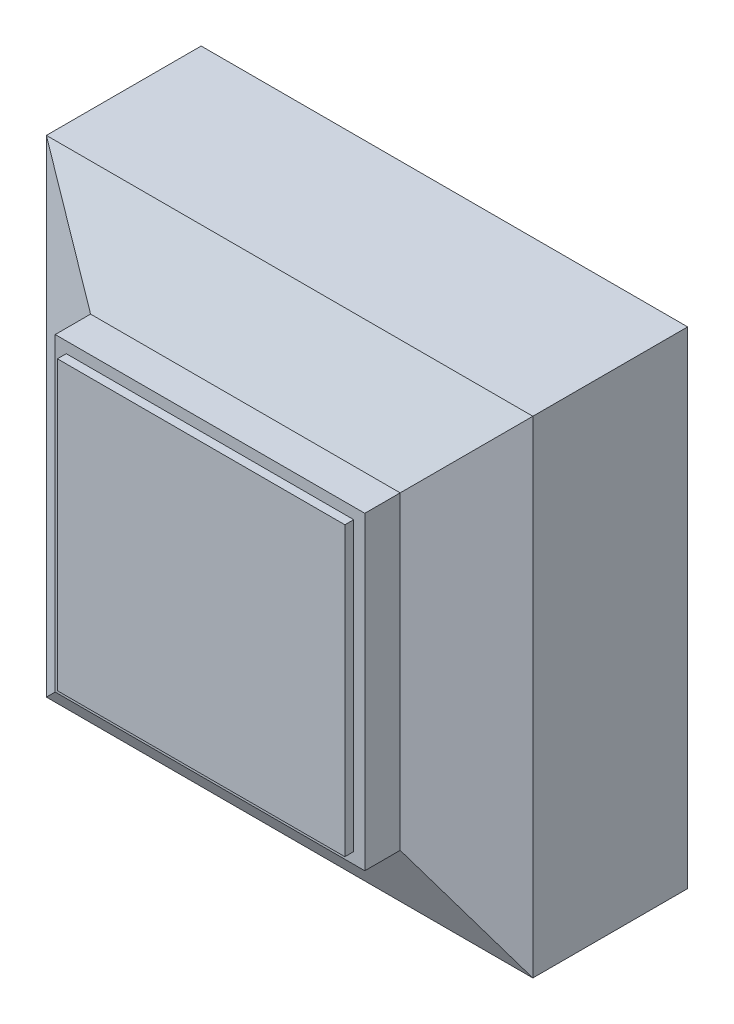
ISO-10303-21;
HEADER;
FILE_DESCRIPTION(('STEP AP214'),'2;1');
FILE_NAME('part.step','',(''),(''),'','','');
FILE_SCHEMA(('AUTOMOTIVE_DESIGN { 1 0 10303 214 1 1 1 1 }'));
ENDSEC;
DATA;
#1=APPLICATION_CONTEXT('core data for automotive mechanical design processes');
#2=APPLICATION_PROTOCOL_DEFINITION('international standard','automotive_design',2000,#1);
#3=PRODUCT_CONTEXT('',#1,'mechanical');
#4=PRODUCT('Part','Part','',(#3));
#5=PRODUCT_RELATED_PRODUCT_CATEGORY('part','',(#4));
#6=PRODUCT_DEFINITION_FORMATION('','',#4);
#7=PRODUCT_DEFINITION_CONTEXT('part definition',#1,'design');
#8=PRODUCT_DEFINITION('design','',#6,#7);
#9=PRODUCT_DEFINITION_SHAPE('','',#8);
#10=(LENGTH_UNIT() NAMED_UNIT(*) SI_UNIT(.MILLI.,.METRE.));
#11=(NAMED_UNIT(*) PLANE_ANGLE_UNIT() SI_UNIT($,.RADIAN.));
#12=(NAMED_UNIT(*) SI_UNIT($,.STERADIAN.) SOLID_ANGLE_UNIT());
#13=UNCERTAINTY_MEASURE_WITH_UNIT(LENGTH_MEASURE(1.E-05),#10,'distance_accuracy_value','');
#14=(GEOMETRIC_REPRESENTATION_CONTEXT(3) GLOBAL_UNCERTAINTY_ASSIGNED_CONTEXT((#13)) GLOBAL_UNIT_ASSIGNED_CONTEXT((#10,
#11,#12)) REPRESENTATION_CONTEXT('',''));
#15=CARTESIAN_POINT('',(0.,0.,0.));
#16=DIRECTION('',(0.,0.,1.));
#17=DIRECTION('',(1.,0.,0.));
#18=AXIS2_PLACEMENT_3D('',#15,#16,#17);
#19=CARTESIAN_POINT('',(-17.24368246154,7.305054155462,5.5));
#20=DIRECTION('',(0.,0.,1.));
#21=DIRECTION('',(1.,0.,0.));
#22=AXIS2_PLACEMENT_3D('',#19,#20,#21);
#23=PLANE('',#22);
#24=DIRECTION('',(0.,1.,0.));
#25=VECTOR('',#24,1.);
#26=CARTESIAN_POINT('',(-20.49368246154,4.055054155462,5.5));
#27=LINE('',#26,#25);
#28=CARTESIAN_POINT('',(-20.49368246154,4.055054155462,5.5));
#29=VERTEX_POINT('',#28);
#30=CARTESIAN_POINT('',(-20.49368246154,10.555054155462,5.5));
#31=VERTEX_POINT('',#30);
#32=EDGE_CURVE('E120',#29,#31,#27,.T.);
#33=ORIENTED_EDGE('',*,*,#32,.F.);
#34=DIRECTION('',(1.,0.,0.));
#35=VECTOR('',#34,1.);
#36=CARTESIAN_POINT('',(-13.99368246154,4.055054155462,5.5));
#37=LINE('',#36,#35);
#38=CARTESIAN_POINT('',(-13.99368246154,4.055054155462,5.5));
#39=VERTEX_POINT('',#38);
#40=EDGE_CURVE('E104',#39,#29,#37,.F.);
#41=ORIENTED_EDGE('',*,*,#40,.F.);
#42=DIRECTION('',(0.,1.,0.));
#43=VECTOR('',#42,1.);
#44=CARTESIAN_POINT('',(-13.99368246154,10.555054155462,5.5));
#45=LINE('',#44,#43);
#46=CARTESIAN_POINT('',(-13.99368246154,10.555054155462,5.5));
#47=VERTEX_POINT('',#46);
#48=EDGE_CURVE('E20',#47,#39,#45,.F.);
#49=ORIENTED_EDGE('',*,*,#48,.F.);
#50=DIRECTION('',(1.,0.,0.));
#51=VECTOR('',#50,1.);
#52=CARTESIAN_POINT('',(-20.49368246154,10.555054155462,5.5));
#53=LINE('',#52,#51);
#54=EDGE_CURVE('E127',#31,#47,#53,.T.);
#55=ORIENTED_EDGE('',*,*,#54,.F.);
#56=EDGE_LOOP('',(#33,#41,#49,#55));
#57=FACE_BOUND('',#56,.T.);
#58=ADVANCED_FACE('F17',(#57),#23,.T.);
#59=CARTESIAN_POINT('',(-13.99368246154,10.555054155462,5.3));
#60=DIRECTION('',(1.,0.,0.));
#61=DIRECTION('',(0.,0.,-1.));
#62=AXIS2_PLACEMENT_3D('',#59,#60,#61);
#63=PLANE('',#62);
#64=DIRECTION('',(0.,1.,0.));
#65=VECTOR('',#64,1.);
#66=CARTESIAN_POINT('',(-13.99368246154,7.305054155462,5.3));
#67=LINE('',#66,#65);
#68=CARTESIAN_POINT('',(-13.99368246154,10.555054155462,5.3));
#69=VERTEX_POINT('',#68);
#70=CARTESIAN_POINT('',(-13.99368246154,4.055054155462,5.3));
#71=VERTEX_POINT('',#70);
#72=EDGE_CURVE('E133',#69,#71,#67,.F.);
#73=ORIENTED_EDGE('',*,*,#72,.F.);
#74=DIRECTION('',(0.,0.,1.));
#75=VECTOR('',#74,1.);
#76=CARTESIAN_POINT('',(-13.99368246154,10.555054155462,5.3));
#77=LINE('',#76,#75);
#78=EDGE_CURVE('E115',#47,#69,#77,.F.);
#79=ORIENTED_EDGE('',*,*,#78,.F.);
#80=ORIENTED_EDGE('',*,*,#48,.T.);
#81=DIRECTION('',(0.,0.,-1.));
#82=VECTOR('',#81,1.);
#83=CARTESIAN_POINT('',(-13.99368246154,4.055054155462,5.3));
#84=LINE('',#83,#82);
#85=EDGE_CURVE('E113',#71,#39,#84,.F.);
#86=ORIENTED_EDGE('',*,*,#85,.F.);
#87=EDGE_LOOP('',(#73,#79,#80,#86));
#88=FACE_BOUND('',#87,.T.);
#89=ADVANCED_FACE('F112',(#88),#63,.T.);
#90=CARTESIAN_POINT('',(-13.99368246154,4.055054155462,5.3));
#91=DIRECTION('',(0.,-1.,0.));
#92=DIRECTION('',(0.,0.,-1.));
#93=AXIS2_PLACEMENT_3D('',#90,#91,#92);
#94=PLANE('',#93);
#95=DIRECTION('',(1.,0.,0.));
#96=VECTOR('',#95,1.);
#97=CARTESIAN_POINT('',(-17.24368246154,4.055054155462,5.3));
#98=LINE('',#97,#96);
#99=CARTESIAN_POINT('',(-20.49368246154,4.055054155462,5.3));
#100=VERTEX_POINT('',#99);
#101=EDGE_CURVE('E119',#71,#100,#98,.F.);
#102=ORIENTED_EDGE('',*,*,#101,.F.);
#103=ORIENTED_EDGE('',*,*,#85,.T.);
#104=ORIENTED_EDGE('',*,*,#40,.T.);
#105=DIRECTION('',(0.,0.,1.));
#106=VECTOR('',#105,1.);
#107=CARTESIAN_POINT('',(-20.49368246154,4.055054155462,5.3));
#108=LINE('',#107,#106);
#109=EDGE_CURVE('E125',#100,#29,#108,.T.);
#110=ORIENTED_EDGE('',*,*,#109,.F.);
#111=EDGE_LOOP('',(#102,#103,#104,#110));
#112=FACE_BOUND('',#111,.T.);
#113=ADVANCED_FACE('F118',(#112),#94,.T.);
#114=CARTESIAN_POINT('',(-20.49368246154,4.055054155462,5.3));
#115=DIRECTION('',(-1.,0.,0.));
#116=DIRECTION('',(0.,0.,1.));
#117=AXIS2_PLACEMENT_3D('',#114,#115,#116);
#118=PLANE('',#117);
#119=DIRECTION('',(0.,1.,0.));
#120=VECTOR('',#119,1.);
#121=CARTESIAN_POINT('',(-20.49368246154,7.305054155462,5.3));
#122=LINE('',#121,#120);
#123=CARTESIAN_POINT('',(-20.49368246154,10.555054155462,5.3));
#124=VERTEX_POINT('',#123);
#125=EDGE_CURVE('E136',#100,#124,#122,.T.);
#126=ORIENTED_EDGE('',*,*,#125,.F.);
#127=ORIENTED_EDGE('',*,*,#109,.T.);
#128=ORIENTED_EDGE('',*,*,#32,.T.);
#129=DIRECTION('',(0.,0.,1.));
#130=VECTOR('',#129,1.);
#131=CARTESIAN_POINT('',(-20.49368246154,10.555054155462,5.3));
#132=LINE('',#131,#130);
#133=EDGE_CURVE('E130',#124,#31,#132,.T.);
#134=ORIENTED_EDGE('',*,*,#133,.F.);
#135=EDGE_LOOP('',(#126,#127,#128,#134));
#136=FACE_BOUND('',#135,.T.);
#137=ADVANCED_FACE('F274',(#136),#118,.T.);
#138=CARTESIAN_POINT('',(-20.49368246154,10.555054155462,5.3));
#139=DIRECTION('',(0.,1.,0.));
#140=DIRECTION('',(0.,0.,1.));
#141=AXIS2_PLACEMENT_3D('',#138,#139,#140);
#142=PLANE('',#141);
#143=DIRECTION('',(1.,0.,0.));
#144=VECTOR('',#143,1.);
#145=CARTESIAN_POINT('',(-17.24368246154,10.555054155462,5.3));
#146=LINE('',#145,#144);
#147=EDGE_CURVE('E138',#124,#69,#146,.T.);
#148=ORIENTED_EDGE('',*,*,#147,.F.);
#149=ORIENTED_EDGE('',*,*,#133,.T.);
#150=ORIENTED_EDGE('',*,*,#54,.T.);
#151=ORIENTED_EDGE('',*,*,#78,.T.);
#152=EDGE_LOOP('',(#148,#149,#150,#151));
#153=FACE_BOUND('',#152,.T.);
#154=ADVANCED_FACE('F270',(#153),#142,.T.);
#155=CARTESIAN_POINT('',(-17.24368246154,7.305054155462,5.3));
#156=DIRECTION('',(0.,0.,1.));
#157=DIRECTION('',(1.,0.,0.));
#158=AXIS2_PLACEMENT_3D('',#155,#156,#157);
#159=PLANE('',#158);
#160=ORIENTED_EDGE('',*,*,#125,.T.);
#161=ORIENTED_EDGE('',*,*,#147,.T.);
#162=ORIENTED_EDGE('',*,*,#72,.T.);
#163=ORIENTED_EDGE('',*,*,#101,.T.);
#164=EDGE_LOOP('',(#160,#161,#162,#163));
#165=FACE_BOUND('',#164,.T.);
#166=DIRECTION('',(1.,0.,0.));
#167=VECTOR('',#166,1.);
#168=CARTESIAN_POINT('',(-20.74368246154,10.805054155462,5.3));
#169=LINE('',#168,#167);
#170=CARTESIAN_POINT('',(-20.74368246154,10.805054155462,5.3));
#171=VERTEX_POINT('',#170);
#172=CARTESIAN_POINT('',(-13.74368246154,10.805054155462,5.3));
#173=VERTEX_POINT('',#172);
#174=EDGE_CURVE('E151',#171,#173,#169,.T.);
#175=ORIENTED_EDGE('',*,*,#174,.F.);
#176=DIRECTION('',(0.,1.,0.));
#177=VECTOR('',#176,1.);
#178=CARTESIAN_POINT('',(-20.74368246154,3.805054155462,5.3));
#179=LINE('',#178,#177);
#180=CARTESIAN_POINT('',(-20.74368246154,3.805054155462,5.3));
#181=VERTEX_POINT('',#180);
#182=EDGE_CURVE('E141',#181,#171,#179,.T.);
#183=ORIENTED_EDGE('',*,*,#182,.F.);
#184=DIRECTION('',(1.,0.,0.));
#185=VECTOR('',#184,1.);
#186=CARTESIAN_POINT('',(-13.74368246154,3.805054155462,5.3));
#187=LINE('',#186,#185);
#188=CARTESIAN_POINT('',(-13.74368246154,3.805054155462,5.3));
#189=VERTEX_POINT('',#188);
#190=EDGE_CURVE('E143',#189,#181,#187,.F.);
#191=ORIENTED_EDGE('',*,*,#190,.F.);
#192=DIRECTION('',(0.,1.,0.));
#193=VECTOR('',#192,1.);
#194=CARTESIAN_POINT('',(-13.74368246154,10.805054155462,5.3));
#195=LINE('',#194,#193);
#196=EDGE_CURVE('E147',#173,#189,#195,.F.);
#197=ORIENTED_EDGE('',*,*,#196,.F.);
#198=EDGE_LOOP('',(#175,#183,#191,#197));
#199=FACE_BOUND('',#198,.T.);
#200=ADVANCED_FACE('F266',(#165,#199),#159,.T.);
#201=CARTESIAN_POINT('',(-20.74368246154,3.805054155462,4.5));
#202=DIRECTION('',(-1.,0.,0.));
#203=DIRECTION('',(0.,0.,1.));
#204=AXIS2_PLACEMENT_3D('',#201,#202,#203);
#205=PLANE('',#204);
#206=DIRECTION('',(0.,1.,0.));
#207=VECTOR('',#206,1.);
#208=CARTESIAN_POINT('',(-20.74368246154,4.555054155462,4.5));
#209=LINE('',#208,#207);
#210=CARTESIAN_POINT('',(-20.74368246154,3.805054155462,4.5));
#211=VERTEX_POINT('',#210);
#212=CARTESIAN_POINT('',(-20.74368246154,10.805054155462,4.5));
#213=VERTEX_POINT('',#212);
#214=EDGE_CURVE('E158',#211,#213,#209,.T.);
#215=ORIENTED_EDGE('',*,*,#214,.F.);
#216=DIRECTION('',(0.,0.,-1.));
#217=VECTOR('',#216,1.);
#218=CARTESIAN_POINT('',(-20.74368246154,3.805054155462,4.5));
#219=LINE('',#218,#217);
#220=EDGE_CURVE('E145',#181,#211,#219,.T.);
#221=ORIENTED_EDGE('',*,*,#220,.F.);
#222=ORIENTED_EDGE('',*,*,#182,.T.);
#223=DIRECTION('',(0.,0.,1.));
#224=VECTOR('',#223,1.);
#225=CARTESIAN_POINT('',(-20.74368246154,10.805054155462,4.5));
#226=LINE('',#225,#224);
#227=EDGE_CURVE('E155',#213,#171,#226,.T.);
#228=ORIENTED_EDGE('',*,*,#227,.F.);
#229=EDGE_LOOP('',(#215,#221,#222,#228));
#230=FACE_BOUND('',#229,.T.);
#231=ADVANCED_FACE('F262',(#230),#205,.T.);
#232=CARTESIAN_POINT('',(-13.74368246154,3.805054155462,4.5));
#233=DIRECTION('',(0.,-1.,0.));
#234=DIRECTION('',(0.,0.,-1.));
#235=AXIS2_PLACEMENT_3D('',#232,#233,#234);
#236=PLANE('',#235);
#237=DIRECTION('',(1.,0.,0.));
#238=VECTOR('',#237,1.);
#239=CARTESIAN_POINT('',(-14.49368246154,3.805054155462,4.5));
#240=LINE('',#239,#238);
#241=CARTESIAN_POINT('',(-13.74368246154,3.805054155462,4.5));
#242=VERTEX_POINT('',#241);
#243=EDGE_CURVE('E160',#242,#211,#240,.F.);
#244=ORIENTED_EDGE('',*,*,#243,.F.);
#245=DIRECTION('',(0.,0.,-1.));
#246=VECTOR('',#245,1.);
#247=CARTESIAN_POINT('',(-13.74368246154,3.805054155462,4.5));
#248=LINE('',#247,#246);
#249=EDGE_CURVE('E149',#189,#242,#248,.T.);
#250=ORIENTED_EDGE('',*,*,#249,.F.);
#251=ORIENTED_EDGE('',*,*,#190,.T.);
#252=ORIENTED_EDGE('',*,*,#220,.T.);
#253=EDGE_LOOP('',(#244,#250,#251,#252));
#254=FACE_BOUND('',#253,.T.);
#255=ADVANCED_FACE('F258',(#254),#236,.T.);
#256=CARTESIAN_POINT('',(-13.74368246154,10.805054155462,4.5));
#257=DIRECTION('',(1.,0.,0.));
#258=DIRECTION('',(0.,0.,-1.));
#259=AXIS2_PLACEMENT_3D('',#256,#257,#258);
#260=PLANE('',#259);
#261=DIRECTION('',(0.,1.,0.));
#262=VECTOR('',#261,1.);
#263=CARTESIAN_POINT('',(-13.74368246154,10.055054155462,4.5));
#264=LINE('',#263,#262);
#265=CARTESIAN_POINT('',(-13.74368246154,10.805054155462,4.5));
#266=VERTEX_POINT('',#265);
#267=EDGE_CURVE('E167',#266,#242,#264,.F.);
#268=ORIENTED_EDGE('',*,*,#267,.F.);
#269=DIRECTION('',(0.,0.,1.));
#270=VECTOR('',#269,1.);
#271=CARTESIAN_POINT('',(-13.74368246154,10.805054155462,4.5));
#272=LINE('',#271,#270);
#273=EDGE_CURVE('E153',#173,#266,#272,.F.);
#274=ORIENTED_EDGE('',*,*,#273,.F.);
#275=ORIENTED_EDGE('',*,*,#196,.T.);
#276=ORIENTED_EDGE('',*,*,#249,.T.);
#277=EDGE_LOOP('',(#268,#274,#275,#276));
#278=FACE_BOUND('',#277,.T.);
#279=ADVANCED_FACE('F254',(#278),#260,.T.);
#280=CARTESIAN_POINT('',(-20.74368246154,10.805054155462,4.5));
#281=DIRECTION('',(0.,1.,0.));
#282=DIRECTION('',(0.,0.,1.));
#283=AXIS2_PLACEMENT_3D('',#280,#281,#282);
#284=PLANE('',#283);
#285=DIRECTION('',(1.,0.,0.));
#286=VECTOR('',#285,1.);
#287=CARTESIAN_POINT('',(-19.99368246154,10.805054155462,4.5));
#288=LINE('',#287,#286);
#289=EDGE_CURVE('E175',#213,#266,#288,.T.);
#290=ORIENTED_EDGE('',*,*,#289,.F.);
#291=ORIENTED_EDGE('',*,*,#227,.T.);
#292=ORIENTED_EDGE('',*,*,#174,.T.);
#293=ORIENTED_EDGE('',*,*,#273,.T.);
#294=EDGE_LOOP('',(#290,#291,#292,#293));
#295=FACE_BOUND('',#294,.T.);
#296=ADVANCED_FACE('F250',(#295),#284,.T.);
#297=CARTESIAN_POINT('',(-21.74368246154,4.555054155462,4.));
#298=DIRECTION('',(-0.447213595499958,0.,0.894427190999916));
#299=DIRECTION('',(0.894427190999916,0.,0.447213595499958));
#300=AXIS2_PLACEMENT_3D('',#297,#298,#299);
#301=PLANE('',#300);
#302=DIRECTION('',(0.666666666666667,-0.666666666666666,0.333333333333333));
#303=VECTOR('',#302,1.);
#304=CARTESIAN_POINT('',(-22.74368246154,12.805054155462,3.5));
#305=LINE('',#304,#303);
#306=CARTESIAN_POINT('',(-22.74368246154,12.805054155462,3.5));
#307=VERTEX_POINT('',#306);
#308=EDGE_CURVE('E172',#307,#213,#305,.T.);
#309=ORIENTED_EDGE('',*,*,#308,.F.);
#310=DIRECTION('',(0.,1.,0.));
#311=VECTOR('',#310,1.);
#312=CARTESIAN_POINT('',(-22.74368246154,1.805054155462,3.5));
#313=LINE('',#312,#311);
#314=CARTESIAN_POINT('',(-22.74368246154,1.805054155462,3.5));
#315=VERTEX_POINT('',#314);
#316=EDGE_CURVE('E178',#315,#307,#313,.T.);
#317=ORIENTED_EDGE('',*,*,#316,.F.);
#318=DIRECTION('',(-0.666666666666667,-0.666666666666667,-0.333333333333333));
#319=VECTOR('',#318,1.);
#320=CARTESIAN_POINT('',(-20.74368246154,3.805054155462,4.5));
#321=LINE('',#320,#319);
#322=EDGE_CURVE('E163',#211,#315,#321,.T.);
#323=ORIENTED_EDGE('',*,*,#322,.F.);
#324=ORIENTED_EDGE('',*,*,#214,.T.);
#325=EDGE_LOOP('',(#309,#317,#323,#324));
#326=FACE_BOUND('',#325,.T.);
#327=ADVANCED_FACE('F246',(#326),#301,.T.);
#328=CARTESIAN_POINT('',(-14.49368246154,2.805054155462,4.));
#329=DIRECTION('',(0.,-0.447213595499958,0.894427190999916));
#330=DIRECTION('',(0.,-0.894427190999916,-0.447213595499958));
#331=AXIS2_PLACEMENT_3D('',#328,#329,#330);
#332=PLANE('',#331);
#333=ORIENTED_EDGE('',*,*,#322,.T.);
#334=DIRECTION('',(1.,0.,0.));
#335=VECTOR('',#334,1.);
#336=CARTESIAN_POINT('',(-11.74368246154,1.805054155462,3.5));
#337=LINE('',#336,#335);
#338=CARTESIAN_POINT('',(-11.74368246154,1.805054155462,3.5));
#339=VERTEX_POINT('',#338);
#340=EDGE_CURVE('E180',#339,#315,#337,.F.);
#341=ORIENTED_EDGE('',*,*,#340,.F.);
#342=DIRECTION('',(0.666666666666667,-0.666666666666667,-0.333333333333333));
#343=VECTOR('',#342,1.);
#344=CARTESIAN_POINT('',(-13.74368246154,3.805054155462,4.5));
#345=LINE('',#344,#343);
#346=EDGE_CURVE('E165',#242,#339,#345,.T.);
#347=ORIENTED_EDGE('',*,*,#346,.F.);
#348=ORIENTED_EDGE('',*,*,#243,.T.);
#349=EDGE_LOOP('',(#333,#341,#347,#348));
#350=FACE_BOUND('',#349,.T.);
#351=ADVANCED_FACE('F242',(#350),#332,.T.);
#352=CARTESIAN_POINT('',(-12.74368246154,10.055054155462,4.));
#353=DIRECTION('',(0.447213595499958,0.,0.894427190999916));
#354=DIRECTION('',(0.894427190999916,0.,-0.447213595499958));
#355=AXIS2_PLACEMENT_3D('',#352,#353,#354);
#356=PLANE('',#355);
#357=DIRECTION('',(0.666666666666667,0.666666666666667,-0.333333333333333));
#358=VECTOR('',#357,1.);
#359=CARTESIAN_POINT('',(-13.74368246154,10.805054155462,4.5));
#360=LINE('',#359,#358);
#361=CARTESIAN_POINT('',(-11.74368246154,12.805054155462,3.5));
#362=VERTEX_POINT('',#361);
#363=EDGE_CURVE('E170',#266,#362,#360,.T.);
#364=ORIENTED_EDGE('',*,*,#363,.F.);
#365=ORIENTED_EDGE('',*,*,#267,.T.);
#366=ORIENTED_EDGE('',*,*,#346,.T.);
#367=DIRECTION('',(0.,1.,0.));
#368=VECTOR('',#367,1.);
#369=CARTESIAN_POINT('',(-11.74368246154,12.805054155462,3.5));
#370=LINE('',#369,#368);
#371=EDGE_CURVE('E185',#362,#339,#370,.F.);
#372=ORIENTED_EDGE('',*,*,#371,.F.);
#373=EDGE_LOOP('',(#364,#365,#366,#372));
#374=FACE_BOUND('',#373,.T.);
#375=ADVANCED_FACE('F238',(#374),#356,.T.);
#376=CARTESIAN_POINT('',(-19.99368246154,11.805054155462,4.));
#377=DIRECTION('',(0.,0.447213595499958,0.894427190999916));
#378=DIRECTION('',(0.,-0.894427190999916,0.447213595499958));
#379=AXIS2_PLACEMENT_3D('',#376,#377,#378);
#380=PLANE('',#379);
#381=ORIENTED_EDGE('',*,*,#308,.T.);
#382=ORIENTED_EDGE('',*,*,#289,.T.);
#383=ORIENTED_EDGE('',*,*,#363,.T.);
#384=DIRECTION('',(1.,0.,0.));
#385=VECTOR('',#384,1.);
#386=CARTESIAN_POINT('',(-22.74368246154,12.805054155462,3.5));
#387=LINE('',#386,#385);
#388=EDGE_CURVE('E190',#307,#362,#387,.T.);
#389=ORIENTED_EDGE('',*,*,#388,.F.);
#390=EDGE_LOOP('',(#381,#382,#383,#389));
#391=FACE_BOUND('',#390,.T.);
#392=ADVANCED_FACE('F235',(#391),#380,.T.);
#393=CARTESIAN_POINT('',(-22.74368246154,1.805054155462,0.));
#394=DIRECTION('',(-1.,0.,0.));
#395=DIRECTION('',(0.,0.,1.));
#396=AXIS2_PLACEMENT_3D('',#393,#394,#395);
#397=PLANE('',#396);
#398=DIRECTION('',(0.,1.,0.));
#399=VECTOR('',#398,1.);
#400=CARTESIAN_POINT('',(-22.74368246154,7.305054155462,0.));
#401=LINE('',#400,#399);
#402=CARTESIAN_POINT('',(-22.74368246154,12.805054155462,0.));
#403=VERTEX_POINT('',#402);
#404=CARTESIAN_POINT('',(-22.74368246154,1.805054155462,0.));
#405=VERTEX_POINT('',#404);
#406=EDGE_CURVE('E196',#403,#405,#401,.F.);
#407=ORIENTED_EDGE('',*,*,#406,.T.);
#408=DIRECTION('',(0.,0.,-1.));
#409=VECTOR('',#408,1.);
#410=CARTESIAN_POINT('',(-22.74368246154,1.805054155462,0.));
#411=LINE('',#410,#409);
#412=EDGE_CURVE('E183',#315,#405,#411,.T.);
#413=ORIENTED_EDGE('',*,*,#412,.F.);
#414=ORIENTED_EDGE('',*,*,#316,.T.);
#415=DIRECTION('',(0.,0.,1.));
#416=VECTOR('',#415,1.);
#417=CARTESIAN_POINT('',(-22.74368246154,12.805054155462,0.));
#418=LINE('',#417,#416);
#419=EDGE_CURVE('E193',#403,#307,#418,.T.);
#420=ORIENTED_EDGE('',*,*,#419,.F.);
#421=EDGE_LOOP('',(#407,#413,#414,#420));
#422=FACE_BOUND('',#421,.T.);
#423=ADVANCED_FACE('F216',(#422),#397,.T.);
#424=CARTESIAN_POINT('',(-11.74368246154,1.805054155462,0.));
#425=DIRECTION('',(0.,-1.,0.));
#426=DIRECTION('',(0.,0.,-1.));
#427=AXIS2_PLACEMENT_3D('',#424,#425,#426);
#428=PLANE('',#427);
#429=DIRECTION('',(1.,0.,0.));
#430=VECTOR('',#429,1.);
#431=CARTESIAN_POINT('',(-17.24368246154,1.805054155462,0.));
#432=LINE('',#431,#430);
#433=CARTESIAN_POINT('',(-11.74368246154,1.805054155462,0.));
#434=VERTEX_POINT('',#433);
#435=EDGE_CURVE('E199',#405,#434,#432,.T.);
#436=ORIENTED_EDGE('',*,*,#435,.T.);
#437=DIRECTION('',(0.,0.,-1.));
#438=VECTOR('',#437,1.);
#439=CARTESIAN_POINT('',(-11.74368246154,1.805054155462,0.));
#440=LINE('',#439,#438);
#441=EDGE_CURVE('E188',#339,#434,#440,.T.);
#442=ORIENTED_EDGE('',*,*,#441,.F.);
#443=ORIENTED_EDGE('',*,*,#340,.T.);
#444=ORIENTED_EDGE('',*,*,#412,.T.);
#445=EDGE_LOOP('',(#436,#442,#443,#444));
#446=FACE_BOUND('',#445,.T.);
#447=ADVANCED_FACE('F211',(#446),#428,.T.);
#448=CARTESIAN_POINT('',(-11.74368246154,12.805054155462,0.));
#449=DIRECTION('',(1.,0.,0.));
#450=DIRECTION('',(0.,0.,-1.));
#451=AXIS2_PLACEMENT_3D('',#448,#449,#450);
#452=PLANE('',#451);
#453=DIRECTION('',(0.,1.,0.));
#454=VECTOR('',#453,1.);
#455=CARTESIAN_POINT('',(-11.74368246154,7.305054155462,0.));
#456=LINE('',#455,#454);
#457=CARTESIAN_POINT('',(-11.74368246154,12.805054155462,0.));
#458=VERTEX_POINT('',#457);
#459=EDGE_CURVE('E26',#434,#458,#456,.T.);
#460=ORIENTED_EDGE('',*,*,#459,.T.);
#461=DIRECTION('',(0.,0.,1.));
#462=VECTOR('',#461,1.);
#463=CARTESIAN_POINT('',(-11.74368246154,12.805054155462,0.));
#464=LINE('',#463,#462);
#465=EDGE_CURVE('E34',#362,#458,#464,.F.);
#466=ORIENTED_EDGE('',*,*,#465,.F.);
#467=ORIENTED_EDGE('',*,*,#371,.T.);
#468=ORIENTED_EDGE('',*,*,#441,.T.);
#469=EDGE_LOOP('',(#460,#466,#467,#468));
#470=FACE_BOUND('',#469,.T.);
#471=ADVANCED_FACE('F205',(#470),#452,.T.);
#472=CARTESIAN_POINT('',(-22.74368246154,12.805054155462,0.));
#473=DIRECTION('',(0.,1.,0.));
#474=DIRECTION('',(0.,0.,1.));
#475=AXIS2_PLACEMENT_3D('',#472,#473,#474);
#476=PLANE('',#475);
#477=DIRECTION('',(1.,0.,0.));
#478=VECTOR('',#477,1.);
#479=CARTESIAN_POINT('',(-17.24368246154,12.805054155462,0.));
#480=LINE('',#479,#478);
#481=EDGE_CURVE('E11',#458,#403,#480,.F.);
#482=ORIENTED_EDGE('',*,*,#481,.T.);
#483=ORIENTED_EDGE('',*,*,#419,.T.);
#484=ORIENTED_EDGE('',*,*,#388,.T.);
#485=ORIENTED_EDGE('',*,*,#465,.T.);
#486=EDGE_LOOP('',(#482,#483,#484,#485));
#487=FACE_BOUND('',#486,.T.);
#488=ADVANCED_FACE('F220',(#487),#476,.T.);
#489=CARTESIAN_POINT('',(-17.24368246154,7.305054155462,0.));
#490=DIRECTION('',(0.,0.,1.));
#491=DIRECTION('',(1.,0.,0.));
#492=AXIS2_PLACEMENT_3D('',#489,#490,#491);
#493=PLANE('',#492);
#494=ORIENTED_EDGE('',*,*,#459,.F.);
#495=ORIENTED_EDGE('',*,*,#435,.F.);
#496=ORIENTED_EDGE('',*,*,#406,.F.);
#497=ORIENTED_EDGE('',*,*,#481,.F.);
#498=EDGE_LOOP('',(#494,#495,#496,#497));
#499=FACE_BOUND('',#498,.T.);
#500=ADVANCED_FACE('F209',(#499),#493,.F.);
#501=CLOSED_SHELL('',(#58,#89,#113,#137,#154,#200,#231,#255,#279,#296,#327,#351,#375,#392,#423,
#447,#471,#488,#500));
#502=MANIFOLD_SOLID_BREP('B1',#501);
#503=ADVANCED_BREP_SHAPE_REPRESENTATION('',(#18,#502),#14);
#504=SHAPE_DEFINITION_REPRESENTATION(#9,#503);
ENDSEC;
END-ISO-10303-21;
